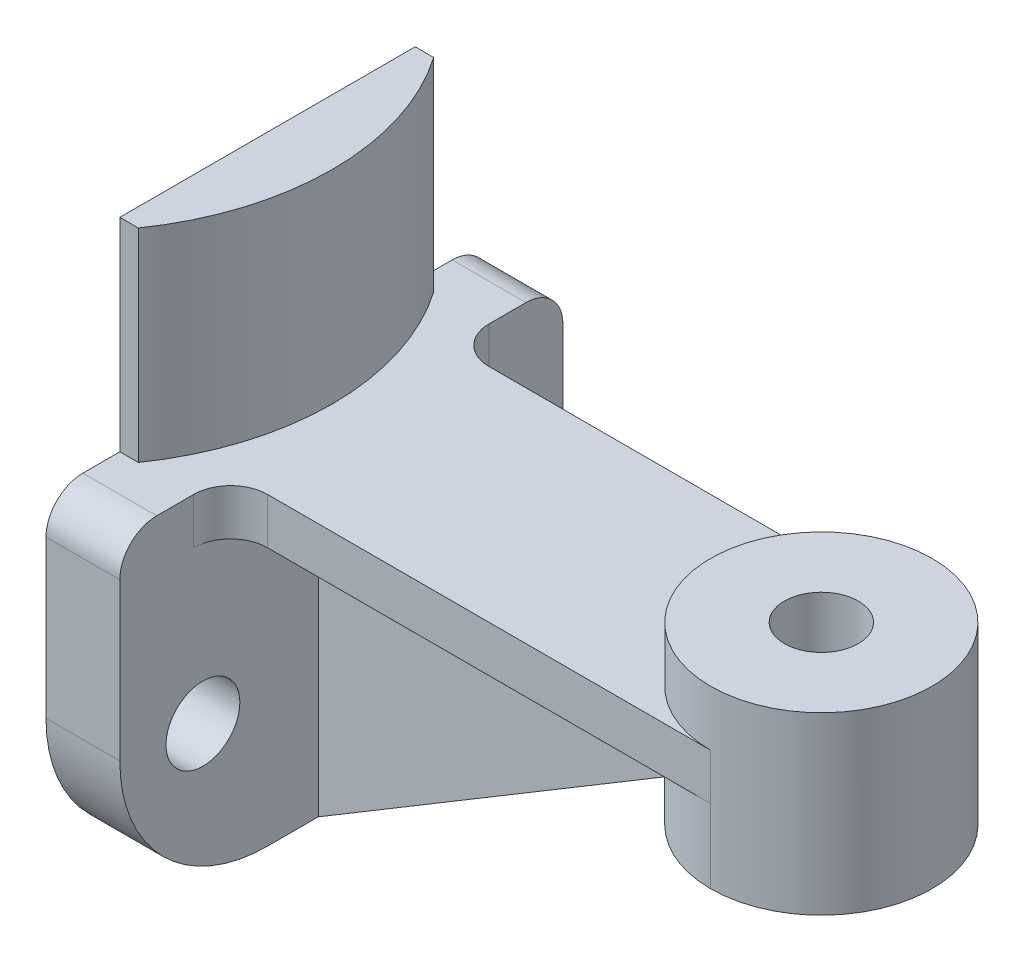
from build123d import *

# Parameters (mm, degrees)
SKETCH1_W           = 76.2
SKETCH1_H           = 58.7375
BASE_EXTRUDE_DEPTH  = 12.7
SKETCH2_W           = 38.1
SKETCH2_H           = 7.9375
BOSS_EXTRUDE3_DEPTH = 82.55
SKETCH4_R           = 19.05
BOSS_EXTRUDE4_DEPTH = 30.1625
BOSS_EXTRUDE5_DEPTH = 34.925
BOSS_EXTRUDE7_DEPTH = 3.96875
SKETCH9_R           = 6.35
CUT_EXTRUDE1_DEPTH  = 158.802610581
SKETCH10_R          = 6.35
CUT_EXTRUDE2_DEPTH  = 154.39719328
FILLET1_R           = 6.35
FILLET2_R           = 25.4


with BuildPart() as part:
    # Sketch1 → Base-Extrude (new body)
    with BuildSketch(Plane(origin=(0, 0, 0), x_dir=(0, 0, -1), z_dir=(1, 0, 0))):
        with Locations((38.1, 29.36875)):
            Rectangle(SKETCH1_W, SKETCH1_H)
    extrude(amount=BASE_EXTRUDE_DEPTH)

    # Sketch2 → Boss-Extrude3 (add)
    with BuildSketch(Plane(origin=(12.7, 0, 0), x_dir=(0, 0, -1), z_dir=(1, 0, 0))):
        with Locations((38.1, 54.76875)):
            Rectangle(SKETCH2_W, SKETCH2_H)
    extrude(amount=BOSS_EXTRUDE3_DEPTH)

    # Sketch4 → Boss-Extrude4 (add)
    with BuildSketch(Plane(origin=(0, 68.2625, 0), x_dir=(-1, 0, 0), z_dir=(0, 1, 0))):
        with Locations(Location((-95.25, -38.1, 0), (0, 0, 90))):
            Circle(SKETCH4_R)
    extrude(amount=-BOSS_EXTRUDE4_DEPTH)

    # Sketch5 → Boss-Extrude5 (add)
    with BuildSketch(Plane(origin=(0, 58.7375, 0), x_dir=(-1, 0, 0), z_dir=(0, 1, 0))):
        with BuildLine():
            Line((0, -63.5), (-3.175, -63.5))
            ThreePointArc((-3.175, -63.5), (-11.147027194, -38.1), (-3.175, -12.7))
            Line((-3.175, -12.7), (0, -12.7))
            Line((0, -12.7), (0, -63.5))
        make_face()
    extrude(amount=BOSS_EXTRUDE5_DEPTH)

    # Sketch8 → Boss-Extrude7 (add, symmetric)
    with BuildSketch(Plane(origin=(0, 0, -38.1), x_dir=(-1, 0, 0), z_dir=(0, 0, -1))):
        Polygon((-12.7, 0), (-95.25, 49.53), (-95.25, 50.8), (-12.7, 50.8), align=None)
    extrude(amount=BOSS_EXTRUDE7_DEPTH, both=True)

    # Sketch9 → Cut-Extrude1 (cut, through all)
    with BuildSketch(Plane(origin=(12.7, 0, 0), x_dir=(0, 0, -1), z_dir=(1, 0, 0))):
        with Locations((14.2875, 23.8125)):
            Circle(SKETCH9_R)
        with Locations((61.9125, 23.8125)):
            Circle(SKETCH9_R)
    extrude(amount=-CUT_EXTRUDE1_DEPTH, mode=Mode.SUBTRACT)

    # Sketch10 → Cut-Extrude2 (cut, through all)
    with BuildSketch(Plane(origin=(0, 68.2625, 0), x_dir=(-1, 0, 0), z_dir=(0, 1, 0))):
        with Locations(Location((-95.25, -38.1, 0), (0, 0, 90))):
            Circle(SKETCH10_R)
    extrude(amount=-CUT_EXTRUDE2_DEPTH, mode=Mode.SUBTRACT)

    # Fillet1
    fillet1_edges = [part.edges().sort_by_distance(p)[0] for p in [
        (12.7, 54.76875, -19.05),
        (12.7, 54.76875, -57.15),
        (6.35, 58.7375, -76.2),
        (6.35, 58.7375, 0),
    ]]
    fillet(fillet1_edges, radius=FILLET1_R)

    # Fillet2
    fillet2_edges = [part.edges().sort_by_distance(p)[0] for p in [
        (6.35, 0, 0),
        (6.35, 0, -76.2),
    ]]
    fillet(fillet2_edges, radius=FILLET2_R)


solid = part.part
